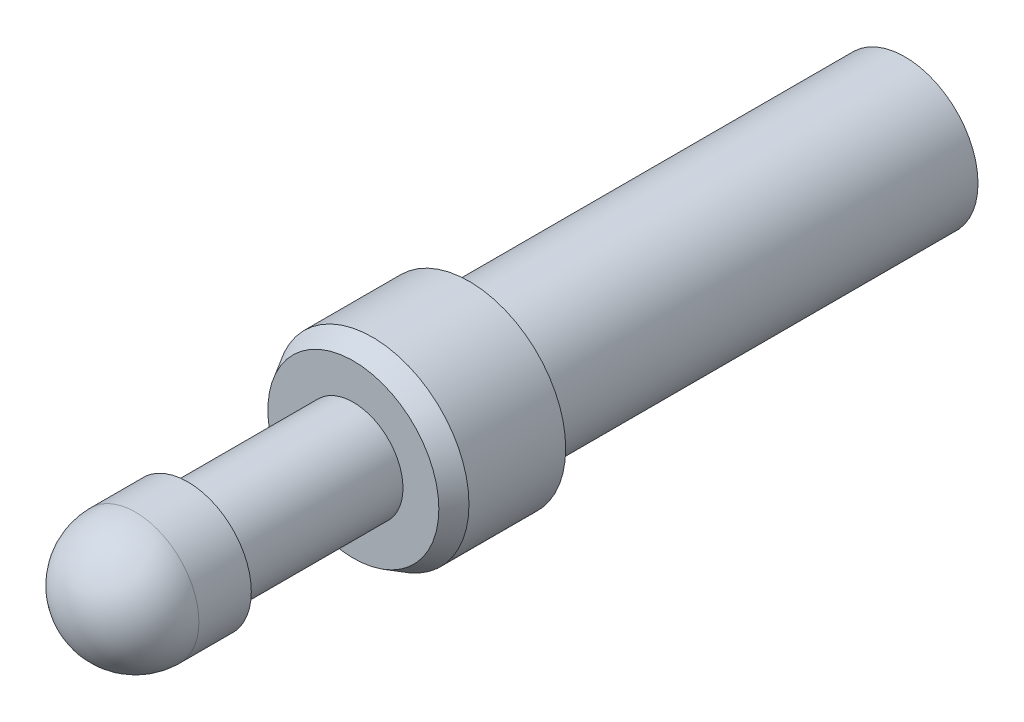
ISO-10303-21;
HEADER;
FILE_DESCRIPTION(('STEP AP214'),'2;1');
FILE_NAME('part.step','',(''),(''),'','','');
FILE_SCHEMA(('AUTOMOTIVE_DESIGN { 1 0 10303 214 1 1 1 1 }'));
ENDSEC;
DATA;
#1=APPLICATION_CONTEXT('core data for automotive mechanical design processes');
#2=APPLICATION_PROTOCOL_DEFINITION('international standard','automotive_design',2000,#1);
#3=PRODUCT_CONTEXT('',#1,'mechanical');
#4=PRODUCT('Part','Part','',(#3));
#5=PRODUCT_RELATED_PRODUCT_CATEGORY('part','',(#4));
#6=PRODUCT_DEFINITION_FORMATION('','',#4);
#7=PRODUCT_DEFINITION_CONTEXT('part definition',#1,'design');
#8=PRODUCT_DEFINITION('design','',#6,#7);
#9=PRODUCT_DEFINITION_SHAPE('','',#8);
#10=(LENGTH_UNIT() NAMED_UNIT(*) SI_UNIT(.MILLI.,.METRE.));
#11=(NAMED_UNIT(*) PLANE_ANGLE_UNIT() SI_UNIT($,.RADIAN.));
#12=(NAMED_UNIT(*) SI_UNIT($,.STERADIAN.) SOLID_ANGLE_UNIT());
#13=UNCERTAINTY_MEASURE_WITH_UNIT(LENGTH_MEASURE(1.E-05),#10,'distance_accuracy_value','');
#14=(GEOMETRIC_REPRESENTATION_CONTEXT(3) GLOBAL_UNCERTAINTY_ASSIGNED_CONTEXT((#13)) GLOBAL_UNIT_ASSIGNED_CONTEXT((#10,
#11,#12)) REPRESENTATION_CONTEXT('',''));
#15=CARTESIAN_POINT('',(0.,0.,0.));
#16=DIRECTION('',(0.,0.,1.));
#17=DIRECTION('',(1.,0.,0.));
#18=AXIS2_PLACEMENT_3D('',#15,#16,#17);
#19=CARTESIAN_POINT('',(0.,0.,10.));
#20=DIRECTION('',(0.,0.,1.));
#21=DIRECTION('',(1.,0.,0.));
#22=AXIS2_PLACEMENT_3D('',#19,#20,#21);
#23=PLANE('',#22);
#24=CARTESIAN_POINT('',(0.,0.,10.));
#25=DIRECTION('',(0.,0.,1.));
#26=DIRECTION('',(1.,0.,0.));
#27=AXIS2_PLACEMENT_3D('',#24,#25,#26);
#28=CIRCLE('',#27,1.55);
#29=CARTESIAN_POINT('',(1.55,0.,10.));
#30=VERTEX_POINT('',#29);
#31=EDGE_CURVE('E49',#30,#30,#28,.T.);
#32=ORIENTED_EDGE('',*,*,#31,.T.);
#33=EDGE_LOOP('',(#32));
#34=FACE_BOUND('',#33,.T.);
#35=CARTESIAN_POINT('',(0.,0.,10.));
#36=DIRECTION('',(0.,0.,1.));
#37=DIRECTION('',(1.,0.,0.));
#38=AXIS2_PLACEMENT_3D('',#35,#36,#37);
#39=CIRCLE('',#38,0.9);
#40=CARTESIAN_POINT('',(0.9,0.,10.));
#41=VERTEX_POINT('',#40);
#42=EDGE_CURVE('E69',#41,#41,#39,.T.);
#43=ORIENTED_EDGE('',*,*,#42,.F.);
#44=EDGE_LOOP('',(#43));
#45=FACE_BOUND('',#44,.T.);
#46=ADVANCED_FACE('F42',(#34,#45),#23,.T.);
#47=CARTESIAN_POINT('',(0.,0.,7.9));
#48=DIRECTION('',(0.,0.,-1.));
#49=DIRECTION('',(-1.,0.,0.));
#50=AXIS2_PLACEMENT_3D('',#47,#48,#49);
#51=CYLINDRICAL_SURFACE('',#50,1.325);
#52=CARTESIAN_POINT('',(0.,0.,7.9));
#53=DIRECTION('',(0.,0.,1.));
#54=DIRECTION('',(1.,0.,0.));
#55=AXIS2_PLACEMENT_3D('',#52,#53,#54);
#56=CIRCLE('',#55,1.325);
#57=CARTESIAN_POINT('',(1.325,0.,7.9));
#58=VERTEX_POINT('',#57);
#59=EDGE_CURVE('E57',#58,#58,#56,.T.);
#60=ORIENTED_EDGE('',*,*,#59,.F.);
#61=EDGE_LOOP('',(#60));
#62=FACE_BOUND('',#61,.T.);
#63=CARTESIAN_POINT('',(0.,0.,0.));
#64=DIRECTION('',(0.,0.,1.));
#65=DIRECTION('',(1.,0.,0.));
#66=AXIS2_PLACEMENT_3D('',#63,#64,#65);
#67=CIRCLE('',#66,1.325);
#68=CARTESIAN_POINT('',(1.325,0.,0.));
#69=VERTEX_POINT('',#68);
#70=EDGE_CURVE('E60',#69,#69,#67,.T.);
#71=ORIENTED_EDGE('',*,*,#70,.T.);
#72=EDGE_LOOP('',(#71));
#73=FACE_BOUND('',#72,.T.);
#74=ADVANCED_FACE('F94',(#62,#73),#51,.T.);
#75=CARTESIAN_POINT('',(0.,0.,0.));
#76=DIRECTION('',(0.,0.,1.));
#77=DIRECTION('',(1.,0.,0.));
#78=AXIS2_PLACEMENT_3D('',#75,#76,#77);
#79=PLANE('',#78);
#80=ORIENTED_EDGE('',*,*,#70,.F.);
#81=EDGE_LOOP('',(#80));
#82=FACE_BOUND('',#81,.T.);
#83=ADVANCED_FACE('F99',(#82),#79,.F.);
#84=CARTESIAN_POINT('',(0.,0.,7.9));
#85=DIRECTION('',(0.,0.,1.));
#86=DIRECTION('',(1.,0.,0.));
#87=AXIS2_PLACEMENT_3D('',#84,#85,#86);
#88=PLANE('',#87);
#89=CARTESIAN_POINT('',(0.,0.,7.9));
#90=DIRECTION('',(0.,0.,1.));
#91=DIRECTION('',(1.,0.,0.));
#92=AXIS2_PLACEMENT_3D('',#89,#90,#91);
#93=CIRCLE('',#92,1.75);
#94=CARTESIAN_POINT('',(1.75,0.,7.9));
#95=VERTEX_POINT('',#94);
#96=EDGE_CURVE('E63',#95,#95,#93,.T.);
#97=ORIENTED_EDGE('',*,*,#96,.F.);
#98=EDGE_LOOP('',(#97));
#99=FACE_BOUND('',#98,.T.);
#100=ORIENTED_EDGE('',*,*,#59,.T.);
#101=EDGE_LOOP('',(#100));
#102=FACE_BOUND('',#101,.T.);
#103=ADVANCED_FACE('F104',(#99,#102),#88,.F.);
#104=CARTESIAN_POINT('',(0.,0.,10.));
#105=DIRECTION('',(0.,0.,-1.));
#106=DIRECTION('',(-1.,0.,0.));
#107=AXIS2_PLACEMENT_3D('',#104,#105,#106);
#108=CYLINDRICAL_SURFACE('',#107,1.75);
#109=CARTESIAN_POINT('',(0.,0.,9.65358983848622));
#110=DIRECTION('',(0.,0.,1.));
#111=DIRECTION('',(1.,0.,0.));
#112=AXIS2_PLACEMENT_3D('',#109,#110,#111);
#113=CIRCLE('',#112,1.75);
#114=CARTESIAN_POINT('',(1.75,0.,9.65358983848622));
#115=VERTEX_POINT('',#114);
#116=EDGE_CURVE('E12',#115,#115,#113,.F.);
#117=ORIENTED_EDGE('',*,*,#116,.T.);
#118=EDGE_LOOP('',(#117));
#119=FACE_BOUND('',#118,.T.);
#120=ORIENTED_EDGE('',*,*,#96,.T.);
#121=EDGE_LOOP('',(#120));
#122=FACE_BOUND('',#121,.T.);
#123=ADVANCED_FACE('F89',(#119,#122),#108,.T.);
#124=CARTESIAN_POINT('',(0.,0.,13.));
#125=DIRECTION('',(0.,0.,-1.));
#126=DIRECTION('',(-1.,0.,0.));
#127=AXIS2_PLACEMENT_3D('',#124,#125,#126);
#128=CYLINDRICAL_SURFACE('',#127,0.9);
#129=CARTESIAN_POINT('',(0.,0.,13.));
#130=DIRECTION('',(0.,0.,1.));
#131=DIRECTION('',(1.,0.,0.));
#132=AXIS2_PLACEMENT_3D('',#129,#130,#131);
#133=CIRCLE('',#132,0.9);
#134=CARTESIAN_POINT('',(0.9,0.,13.));
#135=VERTEX_POINT('',#134);
#136=EDGE_CURVE('E68',#135,#135,#133,.T.);
#137=ORIENTED_EDGE('',*,*,#136,.F.);
#138=EDGE_LOOP('',(#137));
#139=FACE_BOUND('',#138,.T.);
#140=ORIENTED_EDGE('',*,*,#42,.T.);
#141=EDGE_LOOP('',(#140));
#142=FACE_BOUND('',#141,.T.);
#143=ADVANCED_FACE('F83',(#139,#142),#128,.T.);
#144=CARTESIAN_POINT('',(0.,0.,13.));
#145=DIRECTION('',(0.,0.,1.));
#146=DIRECTION('',(1.,0.,0.));
#147=AXIS2_PLACEMENT_3D('',#144,#145,#146);
#148=PLANE('',#147);
#149=CARTESIAN_POINT('',(0.,0.,13.));
#150=DIRECTION('',(0.,0.,1.));
#151=DIRECTION('',(1.,0.,0.));
#152=AXIS2_PLACEMENT_3D('',#149,#150,#151);
#153=CIRCLE('',#152,1.15);
#154=CARTESIAN_POINT('',(1.15,0.,13.));
#155=VERTEX_POINT('',#154);
#156=EDGE_CURVE('E72',#155,#155,#153,.T.);
#157=ORIENTED_EDGE('',*,*,#156,.F.);
#158=EDGE_LOOP('',(#157));
#159=FACE_BOUND('',#158,.T.);
#160=ORIENTED_EDGE('',*,*,#136,.T.);
#161=EDGE_LOOP('',(#160));
#162=FACE_BOUND('',#161,.T.);
#163=ADVANCED_FACE('F80',(#159,#162),#148,.F.);
#164=CARTESIAN_POINT('',(0.,0.,15.1));
#165=DIRECTION('',(0.,0.,-1.));
#166=DIRECTION('',(-1.,0.,0.));
#167=AXIS2_PLACEMENT_3D('',#164,#165,#166);
#168=CYLINDRICAL_SURFACE('',#167,1.15);
#169=CARTESIAN_POINT('',(0.,0.,13.95));
#170=DIRECTION('',(0.,0.,-1.));
#171=DIRECTION('',(-1.,0.,0.));
#172=AXIS2_PLACEMENT_3D('',#169,#170,#171);
#173=CIRCLE('',#172,1.15);
#174=CARTESIAN_POINT('',(-1.15,0.,13.95));
#175=VERTEX_POINT('',#174);
#176=EDGE_CURVE('E53',#175,#175,#173,.T.);
#177=ORIENTED_EDGE('',*,*,#176,.T.);
#178=EDGE_LOOP('',(#177));
#179=FACE_BOUND('',#178,.T.);
#180=ORIENTED_EDGE('',*,*,#156,.T.);
#181=EDGE_LOOP('',(#180));
#182=FACE_BOUND('',#181,.T.);
#183=ADVANCED_FACE('F78',(#179,#182),#168,.T.);
#184=CARTESIAN_POINT('',(0.,0.,13.95));
#185=DIRECTION('',(0.,0.,1.));
#186=DIRECTION('',(1.,0.,0.));
#187=AXIS2_PLACEMENT_3D('',#184,#185,#186);
#188=SPHERICAL_SURFACE('',#187,1.15);
#189=ORIENTED_EDGE('',*,*,#176,.F.);
#190=EDGE_LOOP('',(#189));
#191=FACE_BOUND('',#190,.T.);
#192=ADVANCED_FACE('F112',(#191),#188,.T.);
#193=CARTESIAN_POINT('',(0.,0.,10.));
#194=DIRECTION('',(0.,0.,-1.));
#195=DIRECTION('',(-1.,0.,0.));
#196=AXIS2_PLACEMENT_3D('',#193,#194,#195);
#197=CONICAL_SURFACE('',#196,1.55,0.523598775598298);
#198=ORIENTED_EDGE('',*,*,#116,.F.);
#199=EDGE_LOOP('',(#198));
#200=FACE_BOUND('',#199,.T.);
#201=ORIENTED_EDGE('',*,*,#31,.F.);
#202=EDGE_LOOP('',(#201));
#203=FACE_BOUND('',#202,.T.);
#204=ADVANCED_FACE('F44',(#200,#203),#197,.T.);
#205=CLOSED_SHELL('',(#46,#74,#83,#103,#123,#143,#163,#183,#192,#204));
#206=MANIFOLD_SOLID_BREP('B2',#205);
#207=ADVANCED_BREP_SHAPE_REPRESENTATION('',(#18,#206),#14);
#208=SHAPE_DEFINITION_REPRESENTATION(#9,#207);
ENDSEC;
END-ISO-10303-21;
